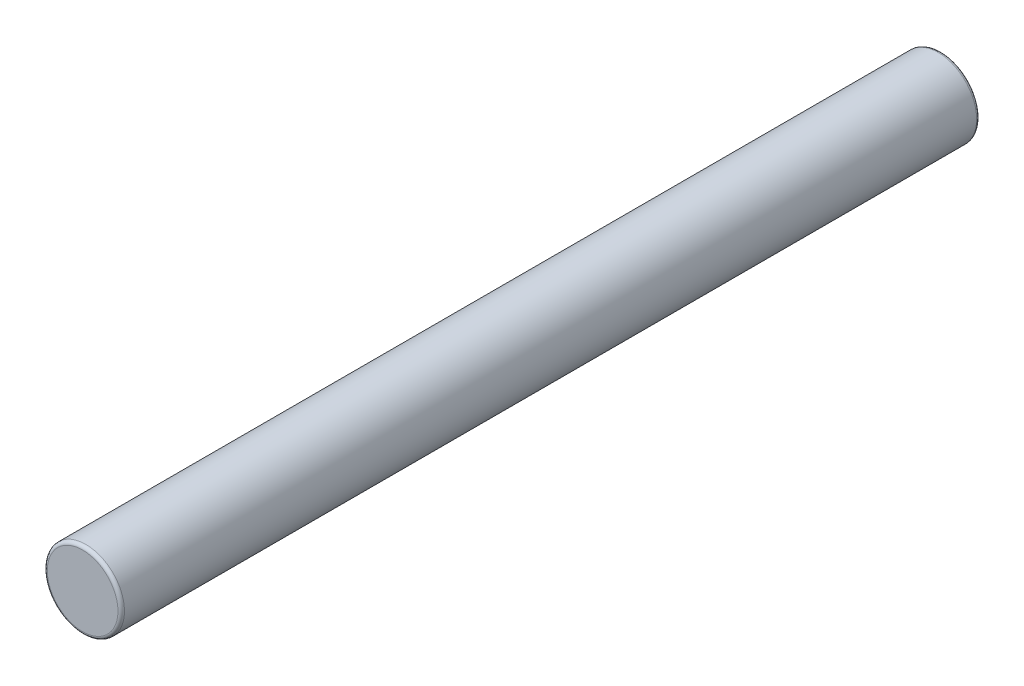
ISO-10303-21;
HEADER;
FILE_DESCRIPTION(('STEP AP214'),'2;1');
FILE_NAME('part.step','',(''),(''),'','','');
FILE_SCHEMA(('AUTOMOTIVE_DESIGN { 1 0 10303 214 1 1 1 1 }'));
ENDSEC;
DATA;
#1=APPLICATION_CONTEXT('core data for automotive mechanical design processes');
#2=APPLICATION_PROTOCOL_DEFINITION('international standard','automotive_design',2000,#1);
#3=PRODUCT_CONTEXT('',#1,'mechanical');
#4=PRODUCT('Part','Part','',(#3));
#5=PRODUCT_RELATED_PRODUCT_CATEGORY('part','',(#4));
#6=PRODUCT_DEFINITION_FORMATION('','',#4);
#7=PRODUCT_DEFINITION_CONTEXT('part definition',#1,'design');
#8=PRODUCT_DEFINITION('design','',#6,#7);
#9=PRODUCT_DEFINITION_SHAPE('','',#8);
#10=(LENGTH_UNIT() NAMED_UNIT(*) SI_UNIT(.MILLI.,.METRE.));
#11=(NAMED_UNIT(*) PLANE_ANGLE_UNIT() SI_UNIT($,.RADIAN.));
#12=(NAMED_UNIT(*) SI_UNIT($,.STERADIAN.) SOLID_ANGLE_UNIT());
#13=UNCERTAINTY_MEASURE_WITH_UNIT(LENGTH_MEASURE(1.E-05),#10,'distance_accuracy_value','');
#14=(GEOMETRIC_REPRESENTATION_CONTEXT(3) GLOBAL_UNCERTAINTY_ASSIGNED_CONTEXT((#13)) GLOBAL_UNIT_ASSIGNED_CONTEXT((#10,
#11,#12)) REPRESENTATION_CONTEXT('',''));
#15=CARTESIAN_POINT('',(0.,0.,0.));
#16=DIRECTION('',(0.,0.,1.));
#17=DIRECTION('',(1.,0.,0.));
#18=AXIS2_PLACEMENT_3D('',#15,#16,#17);
#19=CARTESIAN_POINT('',(0.,0.,16.7386));
#20=DIRECTION('',(0.,0.,-1.));
#21=DIRECTION('',(-1.,0.,0.));
#22=AXIS2_PLACEMENT_3D('',#19,#20,#21);
#23=CYLINDRICAL_SURFACE('',#22,1.50495);
#24=CARTESIAN_POINT('',(0.,0.,16.6116));
#25=DIRECTION('',(0.,0.,1.));
#26=DIRECTION('',(1.,0.,0.));
#27=AXIS2_PLACEMENT_3D('',#24,#25,#26);
#28=CIRCLE('',#27,1.50495);
#29=CARTESIAN_POINT('',(1.50495,0.,16.6116));
#30=VERTEX_POINT('',#29);
#31=EDGE_CURVE('E37',#30,#30,#28,.F.);
#32=ORIENTED_EDGE('',*,*,#31,.T.);
#33=EDGE_LOOP('',(#32));
#34=FACE_BOUND('',#33,.T.);
#35=CARTESIAN_POINT('',(0.,0.,-16.6116));
#36=DIRECTION('',(0.,0.,1.));
#37=DIRECTION('',(1.,0.,0.));
#38=AXIS2_PLACEMENT_3D('',#35,#36,#37);
#39=CIRCLE('',#38,1.50495);
#40=CARTESIAN_POINT('',(1.50495,0.,-16.6116));
#41=VERTEX_POINT('',#40);
#42=EDGE_CURVE('E41',#41,#41,#39,.T.);
#43=ORIENTED_EDGE('',*,*,#42,.T.);
#44=EDGE_LOOP('',(#43));
#45=FACE_BOUND('',#44,.T.);
#46=ADVANCED_FACE('F30',(#34,#45),#23,.T.);
#47=CARTESIAN_POINT('',(0.,0.,16.7386));
#48=DIRECTION('',(0.,0.,1.));
#49=DIRECTION('',(1.,0.,0.));
#50=AXIS2_PLACEMENT_3D('',#47,#48,#49);
#51=PLANE('',#50);
#52=CARTESIAN_POINT('',(0.,0.,16.7386));
#53=DIRECTION('',(0.,0.,1.));
#54=DIRECTION('',(1.,0.,0.));
#55=AXIS2_PLACEMENT_3D('',#52,#53,#54);
#56=CIRCLE('',#55,1.37795);
#57=CARTESIAN_POINT('',(1.37795,0.,16.7386));
#58=VERTEX_POINT('',#57);
#59=EDGE_CURVE('E45',#58,#58,#56,.T.);
#60=ORIENTED_EDGE('',*,*,#59,.T.);
#61=EDGE_LOOP('',(#60));
#62=FACE_BOUND('',#61,.T.);
#63=ADVANCED_FACE('F51',(#62),#51,.T.);
#64=CARTESIAN_POINT('',(0.,0.,-16.7386));
#65=DIRECTION('',(0.,0.,1.));
#66=DIRECTION('',(1.,0.,0.));
#67=AXIS2_PLACEMENT_3D('',#64,#65,#66);
#68=PLANE('',#67);
#69=CARTESIAN_POINT('',(0.,0.,-16.7386));
#70=DIRECTION('',(0.,0.,1.));
#71=DIRECTION('',(1.,0.,0.));
#72=AXIS2_PLACEMENT_3D('',#69,#70,#71);
#73=CIRCLE('',#72,1.37795);
#74=CARTESIAN_POINT('',(1.37795,0.,-16.7386));
#75=VERTEX_POINT('',#74);
#76=EDGE_CURVE('E10',#75,#75,#73,.F.);
#77=ORIENTED_EDGE('',*,*,#76,.T.);
#78=EDGE_LOOP('',(#77));
#79=FACE_BOUND('',#78,.T.);
#80=ADVANCED_FACE('F55',(#79),#68,.F.);
#81=CARTESIAN_POINT('',(0.,0.,16.6116));
#82=DIRECTION('',(0.,0.,1.));
#83=DIRECTION('',(1.,0.,0.));
#84=AXIS2_PLACEMENT_3D('',#81,#82,#83);
#85=TOROIDAL_SURFACE('',#84,1.37795,0.127);
#86=ORIENTED_EDGE('',*,*,#31,.F.);
#87=EDGE_LOOP('',(#86));
#88=FACE_BOUND('',#87,.T.);
#89=ORIENTED_EDGE('',*,*,#59,.F.);
#90=EDGE_LOOP('',(#89));
#91=FACE_BOUND('',#90,.T.);
#92=ADVANCED_FACE('F53',(#88,#91),#85,.T.);
#93=CARTESIAN_POINT('',(0.,0.,-16.6116));
#94=DIRECTION('',(0.,0.,1.));
#95=DIRECTION('',(1.,0.,0.));
#96=AXIS2_PLACEMENT_3D('',#93,#94,#95);
#97=TOROIDAL_SURFACE('',#96,1.37795,0.127);
#98=ORIENTED_EDGE('',*,*,#76,.F.);
#99=EDGE_LOOP('',(#98));
#100=FACE_BOUND('',#99,.T.);
#101=ORIENTED_EDGE('',*,*,#42,.F.);
#102=EDGE_LOOP('',(#101));
#103=FACE_BOUND('',#102,.T.);
#104=ADVANCED_FACE('F32',(#100,#103),#97,.T.);
#105=CLOSED_SHELL('',(#46,#63,#80,#92,#104));
#106=MANIFOLD_SOLID_BREP('B2',#105);
#107=ADVANCED_BREP_SHAPE_REPRESENTATION('',(#18,#106),#14);
#108=SHAPE_DEFINITION_REPRESENTATION(#9,#107);
ENDSEC;
END-ISO-10303-21;
